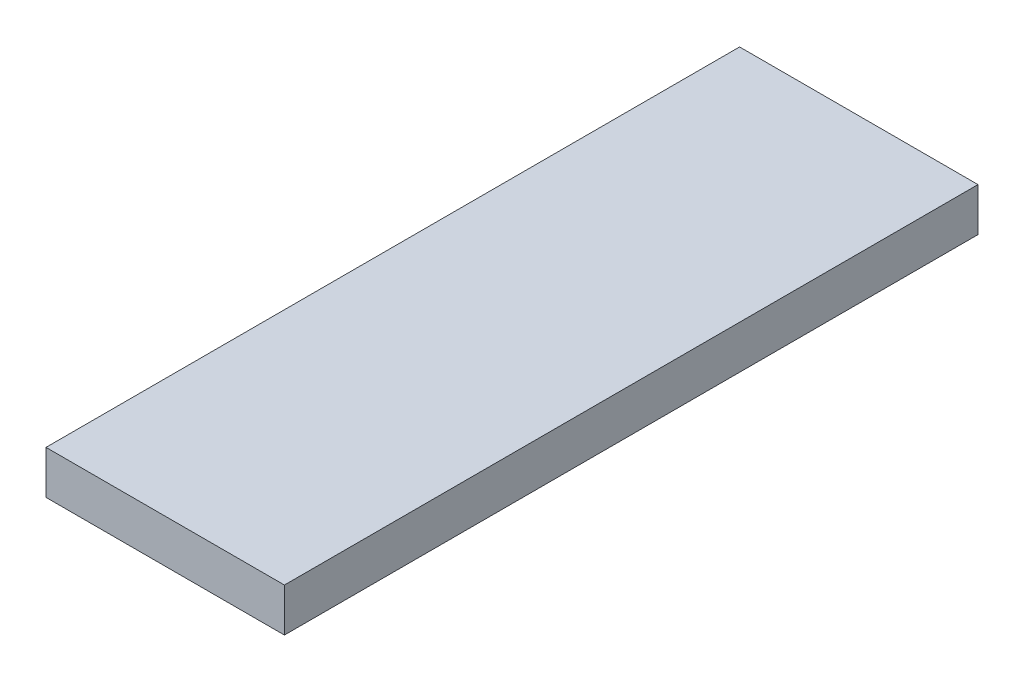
from build123d import *

# Parameters (mm, degrees)
SKETCH2_W           = 55
SKETCH2_H           = 160
BOSS_EXTRUDE1_DEPTH = 10


with BuildPart() as part:
    # Sketch2 → Boss-Extrude1 (new body)
    with BuildSketch(Plane(origin=(0, 0, 0), x_dir=(1, 0, 0), z_dir=(0, 1, 0))):
        with Locations((27.5, 80)):
            Rectangle(SKETCH2_W, SKETCH2_H)
    extrude(amount=BOSS_EXTRUDE1_DEPTH)


solid = part.part
